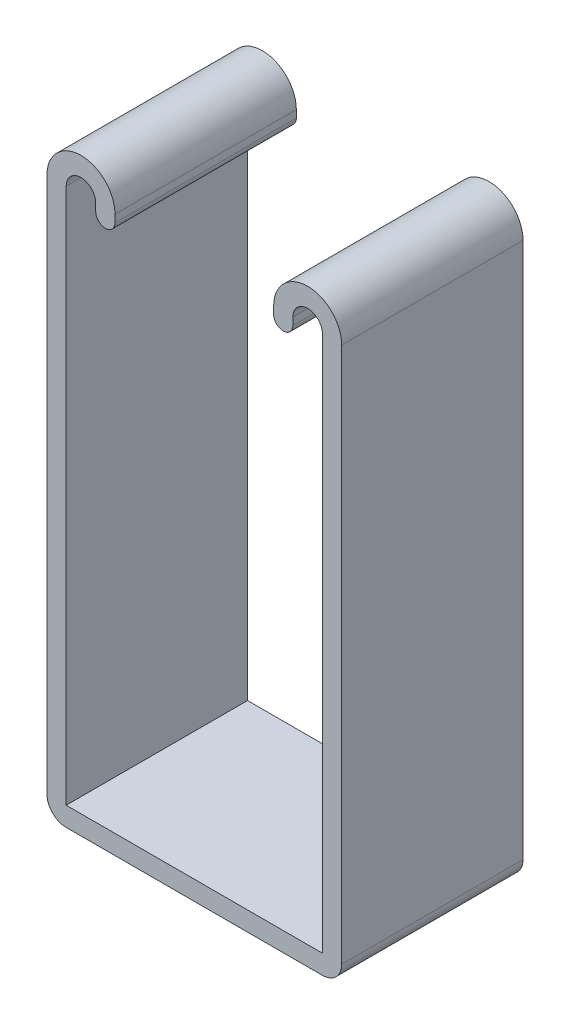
ISO-10303-21;
HEADER;
FILE_DESCRIPTION(('STEP AP214'),'2;1');
FILE_NAME('part.step','',(''),(''),'','','');
FILE_SCHEMA(('AUTOMOTIVE_DESIGN { 1 0 10303 214 1 1 1 1 }'));
ENDSEC;
DATA;
#1=APPLICATION_CONTEXT('core data for automotive mechanical design processes');
#2=APPLICATION_PROTOCOL_DEFINITION('international standard','automotive_design',2000,#1);
#3=PRODUCT_CONTEXT('',#1,'mechanical');
#4=PRODUCT('Part','Part','',(#3));
#5=PRODUCT_RELATED_PRODUCT_CATEGORY('part','',(#4));
#6=PRODUCT_DEFINITION_FORMATION('','',#4);
#7=PRODUCT_DEFINITION_CONTEXT('part definition',#1,'design');
#8=PRODUCT_DEFINITION('design','',#6,#7);
#9=PRODUCT_DEFINITION_SHAPE('','',#8);
#10=(LENGTH_UNIT() NAMED_UNIT(*) SI_UNIT(.MILLI.,.METRE.));
#11=(NAMED_UNIT(*) PLANE_ANGLE_UNIT() SI_UNIT($,.RADIAN.));
#12=(NAMED_UNIT(*) SI_UNIT($,.STERADIAN.) SOLID_ANGLE_UNIT());
#13=UNCERTAINTY_MEASURE_WITH_UNIT(LENGTH_MEASURE(1.E-05),#10,'distance_accuracy_value','');
#14=(GEOMETRIC_REPRESENTATION_CONTEXT(3) GLOBAL_UNCERTAINTY_ASSIGNED_CONTEXT((#13)) GLOBAL_UNIT_ASSIGNED_CONTEXT((#10,
#11,#12)) REPRESENTATION_CONTEXT('',''));
#15=CARTESIAN_POINT('',(0.,0.,0.));
#16=DIRECTION('',(0.,0.,1.));
#17=DIRECTION('',(1.,0.,0.));
#18=AXIS2_PLACEMENT_3D('',#15,#16,#17);
#19=CARTESIAN_POINT('',(-15.875,39.6875,12.7));
#20=DIRECTION('',(0.,0.,-1.));
#21=DIRECTION('',(-1.,0.,0.));
#22=AXIS2_PLACEMENT_3D('',#19,#20,#21);
#23=CYLINDRICAL_SURFACE('',#22,4.7625);
#24=CARTESIAN_POINT('',(-15.875,39.6875,-12.7));
#25=DIRECTION('',(0.,0.,1.));
#26=DIRECTION('',(-1.,0.,0.));
#27=AXIS2_PLACEMENT_3D('',#24,#25,#26);
#28=CIRCLE('',#27,4.7625);
#29=CARTESIAN_POINT('',(-11.1125,39.6875,-12.7));
#30=VERTEX_POINT('',#29);
#31=CARTESIAN_POINT('',(-20.6375,39.6875,-12.7));
#32=VERTEX_POINT('',#31);
#33=EDGE_CURVE('E195',#30,#32,#28,.T.);
#34=ORIENTED_EDGE('',*,*,#33,.T.);
#35=DIRECTION('',(0.,0.,-1.));
#36=VECTOR('',#35,1.);
#37=CARTESIAN_POINT('',(-20.6375,39.6875,12.7));
#38=LINE('',#37,#36);
#39=CARTESIAN_POINT('',(-20.6375,39.6875,12.7));
#40=VERTEX_POINT('',#39);
#41=EDGE_CURVE('E11',#40,#32,#38,.T.);
#42=ORIENTED_EDGE('',*,*,#41,.F.);
#43=CARTESIAN_POINT('',(-15.875,39.6875,12.7));
#44=DIRECTION('',(0.,0.,1.));
#45=DIRECTION('',(-1.,0.,0.));
#46=AXIS2_PLACEMENT_3D('',#43,#44,#45);
#47=CIRCLE('',#46,4.7625);
#48=CARTESIAN_POINT('',(-11.1125,39.6875,12.7));
#49=VERTEX_POINT('',#48);
#50=EDGE_CURVE('E229',#49,#40,#47,.T.);
#51=ORIENTED_EDGE('',*,*,#50,.F.);
#52=DIRECTION('',(0.,0.,-1.));
#53=VECTOR('',#52,1.);
#54=CARTESIAN_POINT('',(-11.1125,39.6875,12.7));
#55=LINE('',#54,#53);
#56=EDGE_CURVE('E191',#49,#30,#55,.T.);
#57=ORIENTED_EDGE('',*,*,#56,.T.);
#58=EDGE_LOOP('',(#34,#42,#51,#57));
#59=FACE_BOUND('',#58,.T.);
#60=ADVANCED_FACE('F39',(#59),#23,.T.);
#61=CARTESIAN_POINT('',(-20.6375,39.6875,12.7));
#62=DIRECTION('',(1.,0.,0.));
#63=DIRECTION('',(0.,1.,0.));
#64=AXIS2_PLACEMENT_3D('',#61,#62,#63);
#65=PLANE('',#64);
#66=DIRECTION('',(0.,-1.,0.));
#67=VECTOR('',#66,1.);
#68=CARTESIAN_POINT('',(-20.6375,39.6875,-12.7));
#69=LINE('',#68,#67);
#70=CARTESIAN_POINT('',(-20.6375,-35.4076,-12.7));
#71=VERTEX_POINT('',#70);
#72=EDGE_CURVE('E198',#32,#71,#69,.T.);
#73=ORIENTED_EDGE('',*,*,#72,.T.);
#74=DIRECTION('',(0.,0.,-1.));
#75=VECTOR('',#74,1.);
#76=CARTESIAN_POINT('',(-20.6375,-35.4076,12.7));
#77=LINE('',#76,#75);
#78=CARTESIAN_POINT('',(-20.6375,-35.4076,12.7));
#79=VERTEX_POINT('',#78);
#80=EDGE_CURVE('E47',#79,#71,#77,.T.);
#81=ORIENTED_EDGE('',*,*,#80,.F.);
#82=DIRECTION('',(0.,-1.,0.));
#83=VECTOR('',#82,1.);
#84=CARTESIAN_POINT('',(-20.6375,39.6875,12.7));
#85=LINE('',#84,#83);
#86=EDGE_CURVE('E128',#40,#79,#85,.T.);
#87=ORIENTED_EDGE('',*,*,#86,.F.);
#88=ORIENTED_EDGE('',*,*,#41,.T.);
#89=EDGE_LOOP('',(#73,#81,#87,#88));
#90=FACE_BOUND('',#89,.T.);
#91=ADVANCED_FACE('F337',(#90),#65,.F.);
#92=CARTESIAN_POINT('',(-17.9451,-35.4076,12.7));
#93=DIRECTION('',(0.,0.,-1.));
#94=DIRECTION('',(-1.,0.,0.));
#95=AXIS2_PLACEMENT_3D('',#92,#93,#94);
#96=CYLINDRICAL_SURFACE('',#95,2.6924);
#97=CARTESIAN_POINT('',(-17.9451,-35.4076,-12.7));
#98=DIRECTION('',(0.,0.,1.));
#99=DIRECTION('',(-1.,0.,0.));
#100=AXIS2_PLACEMENT_3D('',#97,#98,#99);
#101=CIRCLE('',#100,2.6924);
#102=CARTESIAN_POINT('',(-17.9451,-38.1,-12.7));
#103=VERTEX_POINT('',#102);
#104=EDGE_CURVE('E200',#71,#103,#101,.T.);
#105=ORIENTED_EDGE('',*,*,#104,.T.);
#106=DIRECTION('',(0.,0.,-1.));
#107=VECTOR('',#106,1.);
#108=CARTESIAN_POINT('',(-17.9451,-38.1,12.7));
#109=LINE('',#108,#107);
#110=CARTESIAN_POINT('',(-17.9451,-38.1,12.7));
#111=VERTEX_POINT('',#110);
#112=EDGE_CURVE('E266',#111,#103,#109,.T.);
#113=ORIENTED_EDGE('',*,*,#112,.F.);
#114=CARTESIAN_POINT('',(-17.9451,-35.4076,12.7));
#115=DIRECTION('',(0.,0.,1.));
#116=DIRECTION('',(-1.,0.,0.));
#117=AXIS2_PLACEMENT_3D('',#114,#115,#116);
#118=CIRCLE('',#117,2.6924);
#119=EDGE_CURVE('E274',#79,#111,#118,.T.);
#120=ORIENTED_EDGE('',*,*,#119,.F.);
#121=ORIENTED_EDGE('',*,*,#80,.T.);
#122=EDGE_LOOP('',(#105,#113,#120,#121));
#123=FACE_BOUND('',#122,.T.);
#124=ADVANCED_FACE('F272',(#123),#96,.T.);
#125=CARTESIAN_POINT('',(-17.9451,-38.1,12.7));
#126=DIRECTION('',(0.,1.,0.));
#127=DIRECTION('',(-1.,0.,0.));
#128=AXIS2_PLACEMENT_3D('',#125,#126,#127);
#129=PLANE('',#128);
#130=DIRECTION('',(1.,0.,0.));
#131=VECTOR('',#130,1.);
#132=CARTESIAN_POINT('',(-17.9451,-38.1,-12.7));
#133=LINE('',#132,#131);
#134=CARTESIAN_POINT('',(17.9451,-38.1,-12.7));
#135=VERTEX_POINT('',#134);
#136=EDGE_CURVE('E202',#103,#135,#133,.T.);
#137=ORIENTED_EDGE('',*,*,#136,.T.);
#138=DIRECTION('',(0.,0.,-1.));
#139=VECTOR('',#138,1.);
#140=CARTESIAN_POINT('',(17.9451,-38.1,12.7));
#141=LINE('',#140,#139);
#142=CARTESIAN_POINT('',(17.9451,-38.1,12.7));
#143=VERTEX_POINT('',#142);
#144=EDGE_CURVE('E263',#143,#135,#141,.T.);
#145=ORIENTED_EDGE('',*,*,#144,.F.);
#146=DIRECTION('',(1.,0.,0.));
#147=VECTOR('',#146,1.);
#148=CARTESIAN_POINT('',(-17.9451,-38.1,12.7));
#149=LINE('',#148,#147);
#150=EDGE_CURVE('E292',#111,#143,#149,.T.);
#151=ORIENTED_EDGE('',*,*,#150,.F.);
#152=ORIENTED_EDGE('',*,*,#112,.T.);
#153=EDGE_LOOP('',(#137,#145,#151,#152));
#154=FACE_BOUND('',#153,.T.);
#155=ADVANCED_FACE('F283',(#154),#129,.F.);
#156=CARTESIAN_POINT('',(17.9451,-35.4076,12.7));
#157=DIRECTION('',(0.,0.,-1.));
#158=DIRECTION('',(-1.,0.,0.));
#159=AXIS2_PLACEMENT_3D('',#156,#157,#158);
#160=CYLINDRICAL_SURFACE('',#159,2.6924);
#161=CARTESIAN_POINT('',(17.9451,-35.4076,-12.7));
#162=DIRECTION('',(0.,0.,1.));
#163=DIRECTION('',(1.,0.,0.));
#164=AXIS2_PLACEMENT_3D('',#161,#162,#163);
#165=CIRCLE('',#164,2.6924);
#166=CARTESIAN_POINT('',(20.6375,-35.4076,-12.7));
#167=VERTEX_POINT('',#166);
#168=EDGE_CURVE('E204',#135,#167,#165,.T.);
#169=ORIENTED_EDGE('',*,*,#168,.T.);
#170=DIRECTION('',(0.,0.,-1.));
#171=VECTOR('',#170,1.);
#172=CARTESIAN_POINT('',(20.6375,-35.4076,12.7));
#173=LINE('',#172,#171);
#174=CARTESIAN_POINT('',(20.6375,-35.4076,12.7));
#175=VERTEX_POINT('',#174);
#176=EDGE_CURVE('E260',#175,#167,#173,.T.);
#177=ORIENTED_EDGE('',*,*,#176,.F.);
#178=CARTESIAN_POINT('',(17.9451,-35.4076,12.7));
#179=DIRECTION('',(0.,0.,1.));
#180=DIRECTION('',(1.,0.,0.));
#181=AXIS2_PLACEMENT_3D('',#178,#179,#180);
#182=CIRCLE('',#181,2.6924);
#183=EDGE_CURVE('E289',#143,#175,#182,.T.);
#184=ORIENTED_EDGE('',*,*,#183,.F.);
#185=ORIENTED_EDGE('',*,*,#144,.T.);
#186=EDGE_LOOP('',(#169,#177,#184,#185));
#187=FACE_BOUND('',#186,.T.);
#188=ADVANCED_FACE('F287',(#187),#160,.T.);
#189=CARTESIAN_POINT('',(20.6375,-35.4076,12.7));
#190=DIRECTION('',(-1.,0.,0.));
#191=DIRECTION('',(0.,-1.,0.));
#192=AXIS2_PLACEMENT_3D('',#189,#190,#191);
#193=PLANE('',#192);
#194=DIRECTION('',(0.,1.,0.));
#195=VECTOR('',#194,1.);
#196=CARTESIAN_POINT('',(20.6375,-35.4076,-12.7));
#197=LINE('',#196,#195);
#198=CARTESIAN_POINT('',(20.6375,39.6875,-12.7));
#199=VERTEX_POINT('',#198);
#200=EDGE_CURVE('E206',#167,#199,#197,.T.);
#201=ORIENTED_EDGE('',*,*,#200,.T.);
#202=DIRECTION('',(0.,0.,-1.));
#203=VECTOR('',#202,1.);
#204=CARTESIAN_POINT('',(20.6375,39.6875,12.7));
#205=LINE('',#204,#203);
#206=CARTESIAN_POINT('',(20.6375,39.6875,12.7));
#207=VERTEX_POINT('',#206);
#208=EDGE_CURVE('E257',#207,#199,#205,.T.);
#209=ORIENTED_EDGE('',*,*,#208,.F.);
#210=DIRECTION('',(0.,1.,0.));
#211=VECTOR('',#210,1.);
#212=CARTESIAN_POINT('',(20.6375,-35.4076,12.7));
#213=LINE('',#212,#211);
#214=EDGE_CURVE('E291',#175,#207,#213,.T.);
#215=ORIENTED_EDGE('',*,*,#214,.F.);
#216=ORIENTED_EDGE('',*,*,#176,.T.);
#217=EDGE_LOOP('',(#201,#209,#215,#216));
#218=FACE_BOUND('',#217,.T.);
#219=ADVANCED_FACE('F350',(#218),#193,.F.);
#220=CARTESIAN_POINT('',(15.875,39.6875,12.7));
#221=DIRECTION('',(0.,0.,-1.));
#222=DIRECTION('',(-1.,0.,0.));
#223=AXIS2_PLACEMENT_3D('',#220,#221,#222);
#224=CYLINDRICAL_SURFACE('',#223,4.7625);
#225=CARTESIAN_POINT('',(15.875,39.6875,-12.7));
#226=DIRECTION('',(0.,0.,1.));
#227=DIRECTION('',(1.,0.,0.));
#228=AXIS2_PLACEMENT_3D('',#225,#226,#227);
#229=CIRCLE('',#228,4.7625);
#230=CARTESIAN_POINT('',(11.1125,39.6875,-12.7));
#231=VERTEX_POINT('',#230);
#232=EDGE_CURVE('E208',#199,#231,#229,.T.);
#233=ORIENTED_EDGE('',*,*,#232,.T.);
#234=DIRECTION('',(0.,0.,-1.));
#235=VECTOR('',#234,1.);
#236=CARTESIAN_POINT('',(11.1125,39.6875,12.7));
#237=LINE('',#236,#235);
#238=CARTESIAN_POINT('',(11.1125,39.6875,12.7));
#239=VERTEX_POINT('',#238);
#240=EDGE_CURVE('E254',#239,#231,#237,.T.);
#241=ORIENTED_EDGE('',*,*,#240,.F.);
#242=CARTESIAN_POINT('',(15.875,39.6875,12.7));
#243=DIRECTION('',(0.,0.,1.));
#244=DIRECTION('',(1.,0.,0.));
#245=AXIS2_PLACEMENT_3D('',#242,#243,#244);
#246=CIRCLE('',#245,4.7625);
#247=EDGE_CURVE('E294',#207,#239,#246,.T.);
#248=ORIENTED_EDGE('',*,*,#247,.F.);
#249=ORIENTED_EDGE('',*,*,#208,.T.);
#250=EDGE_LOOP('',(#233,#241,#248,#249));
#251=FACE_BOUND('',#250,.T.);
#252=ADVANCED_FACE('F353',(#251),#224,.T.);
#253=CARTESIAN_POINT('',(11.1125,39.6875,12.7));
#254=DIRECTION('',(1.,0.,0.));
#255=DIRECTION('',(0.,1.,0.));
#256=AXIS2_PLACEMENT_3D('',#253,#254,#255);
#257=PLANE('',#256);
#258=DIRECTION('',(0.,-1.,0.));
#259=VECTOR('',#258,1.);
#260=CARTESIAN_POINT('',(11.1125,39.6875,-12.7));
#261=LINE('',#260,#259);
#262=CARTESIAN_POINT('',(11.1125,38.65245,-12.7));
#263=VERTEX_POINT('',#262);
#264=EDGE_CURVE('E210',#231,#263,#261,.T.);
#265=ORIENTED_EDGE('',*,*,#264,.T.);
#266=DIRECTION('',(0.,0.,-1.));
#267=VECTOR('',#266,1.);
#268=CARTESIAN_POINT('',(11.1125,38.65245,12.7));
#269=LINE('',#268,#267);
#270=CARTESIAN_POINT('',(11.1125,38.65245,12.7));
#271=VERTEX_POINT('',#270);
#272=EDGE_CURVE('E251',#271,#263,#269,.T.);
#273=ORIENTED_EDGE('',*,*,#272,.F.);
#274=DIRECTION('',(0.,-1.,0.));
#275=VECTOR('',#274,1.);
#276=CARTESIAN_POINT('',(11.1125,39.6875,12.7));
#277=LINE('',#276,#275);
#278=EDGE_CURVE('E300',#239,#271,#277,.T.);
#279=ORIENTED_EDGE('',*,*,#278,.F.);
#280=ORIENTED_EDGE('',*,*,#240,.T.);
#281=EDGE_LOOP('',(#265,#273,#279,#280));
#282=FACE_BOUND('',#281,.T.);
#283=ADVANCED_FACE('F357',(#282),#257,.F.);
#284=CARTESIAN_POINT('',(12.4587,38.65245,12.7));
#285=DIRECTION('',(0.,0.,-1.));
#286=DIRECTION('',(-1.,0.,0.));
#287=AXIS2_PLACEMENT_3D('',#284,#285,#286);
#288=CYLINDRICAL_SURFACE('',#287,1.3462);
#289=CARTESIAN_POINT('',(12.4587,38.65245,-12.7));
#290=DIRECTION('',(0.,0.,1.));
#291=DIRECTION('',(1.,0.,0.));
#292=AXIS2_PLACEMENT_3D('',#289,#290,#291);
#293=CIRCLE('',#292,1.3462);
#294=CARTESIAN_POINT('',(13.8049,38.65245,-12.7));
#295=VERTEX_POINT('',#294);
#296=EDGE_CURVE('E212',#263,#295,#293,.T.);
#297=ORIENTED_EDGE('',*,*,#296,.T.);
#298=DIRECTION('',(0.,0.,-1.));
#299=VECTOR('',#298,1.);
#300=CARTESIAN_POINT('',(13.8049,38.65245,12.7));
#301=LINE('',#300,#299);
#302=CARTESIAN_POINT('',(13.8049,38.65245,12.7));
#303=VERTEX_POINT('',#302);
#304=EDGE_CURVE('E248',#303,#295,#301,.T.);
#305=ORIENTED_EDGE('',*,*,#304,.F.);
#306=CARTESIAN_POINT('',(12.4587,38.65245,12.7));
#307=DIRECTION('',(0.,0.,1.));
#308=DIRECTION('',(1.,0.,0.));
#309=AXIS2_PLACEMENT_3D('',#306,#307,#308);
#310=CIRCLE('',#309,1.3462);
#311=EDGE_CURVE('E302',#271,#303,#310,.T.);
#312=ORIENTED_EDGE('',*,*,#311,.F.);
#313=ORIENTED_EDGE('',*,*,#272,.T.);
#314=EDGE_LOOP('',(#297,#305,#312,#313));
#315=FACE_BOUND('',#314,.T.);
#316=ADVANCED_FACE('F361',(#315),#288,.T.);
#317=CARTESIAN_POINT('',(13.8049,39.6875,12.7));
#318=DIRECTION('',(-1.,0.,0.));
#319=DIRECTION('',(0.,0.,1.));
#320=AXIS2_PLACEMENT_3D('',#317,#318,#319);
#321=PLANE('',#320);
#322=DIRECTION('',(0.,1.,0.));
#323=VECTOR('',#322,1.);
#324=CARTESIAN_POINT('',(13.8049,39.6875,-12.7));
#325=LINE('',#324,#323);
#326=CARTESIAN_POINT('',(13.8049,39.6875,-12.7));
#327=VERTEX_POINT('',#326);
#328=EDGE_CURVE('E214',#295,#327,#325,.T.);
#329=ORIENTED_EDGE('',*,*,#328,.T.);
#330=DIRECTION('',(0.,0.,-1.));
#331=VECTOR('',#330,1.);
#332=CARTESIAN_POINT('',(13.8049,39.6875,12.7));
#333=LINE('',#332,#331);
#334=CARTESIAN_POINT('',(13.8049,39.6875,12.7));
#335=VERTEX_POINT('',#334);
#336=EDGE_CURVE('E245',#335,#327,#333,.T.);
#337=ORIENTED_EDGE('',*,*,#336,.F.);
#338=DIRECTION('',(0.,1.,0.));
#339=VECTOR('',#338,1.);
#340=CARTESIAN_POINT('',(13.8049,39.6875,12.7));
#341=LINE('',#340,#339);
#342=EDGE_CURVE('E304',#303,#335,#341,.T.);
#343=ORIENTED_EDGE('',*,*,#342,.F.);
#344=ORIENTED_EDGE('',*,*,#304,.T.);
#345=EDGE_LOOP('',(#329,#337,#343,#344));
#346=FACE_BOUND('',#345,.T.);
#347=ADVANCED_FACE('F365',(#346),#321,.F.);
#348=CARTESIAN_POINT('',(15.875,39.6875,12.7));
#349=DIRECTION('',(0.,0.,-1.));
#350=DIRECTION('',(-1.,0.,0.));
#351=AXIS2_PLACEMENT_3D('',#348,#349,#350);
#352=CYLINDRICAL_SURFACE('',#351,2.07010000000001);
#353=CARTESIAN_POINT('',(15.875,39.6875,-12.7));
#354=DIRECTION('',(0.,0.,-1.));
#355=DIRECTION('',(1.,0.,0.));
#356=AXIS2_PLACEMENT_3D('',#353,#354,#355);
#357=CIRCLE('',#356,2.07010000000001);
#358=CARTESIAN_POINT('',(17.9451,39.6875,-12.7));
#359=VERTEX_POINT('',#358);
#360=EDGE_CURVE('E216',#327,#359,#357,.T.);
#361=ORIENTED_EDGE('',*,*,#360,.T.);
#362=DIRECTION('',(0.,0.,-1.));
#363=VECTOR('',#362,1.);
#364=CARTESIAN_POINT('',(17.9451,39.6875,12.7));
#365=LINE('',#364,#363);
#366=CARTESIAN_POINT('',(17.9451,39.6875,12.7));
#367=VERTEX_POINT('',#366);
#368=EDGE_CURVE('E242',#367,#359,#365,.T.);
#369=ORIENTED_EDGE('',*,*,#368,.F.);
#370=CARTESIAN_POINT('',(15.875,39.6875,12.7));
#371=DIRECTION('',(0.,0.,-1.));
#372=DIRECTION('',(1.,0.,0.));
#373=AXIS2_PLACEMENT_3D('',#370,#371,#372);
#374=CIRCLE('',#373,2.07010000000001);
#375=EDGE_CURVE('E306',#335,#367,#374,.T.);
#376=ORIENTED_EDGE('',*,*,#375,.F.);
#377=ORIENTED_EDGE('',*,*,#336,.T.);
#378=EDGE_LOOP('',(#361,#369,#376,#377));
#379=FACE_BOUND('',#378,.T.);
#380=ADVANCED_FACE('F369',(#379),#352,.F.);
#381=CARTESIAN_POINT('',(17.9451,-35.4076,12.7));
#382=DIRECTION('',(1.,0.,0.));
#383=DIRECTION('',(0.,0.,-1.));
#384=AXIS2_PLACEMENT_3D('',#381,#382,#383);
#385=PLANE('',#384);
#386=DIRECTION('',(0.,-1.,0.));
#387=VECTOR('',#386,1.);
#388=CARTESIAN_POINT('',(17.9451,-35.4076,-12.7));
#389=LINE('',#388,#387);
#390=CARTESIAN_POINT('',(17.9451,-35.4076,-12.7));
#391=VERTEX_POINT('',#390);
#392=EDGE_CURVE('E218',#359,#391,#389,.T.);
#393=ORIENTED_EDGE('',*,*,#392,.T.);
#394=DIRECTION('',(0.,0.,-1.));
#395=VECTOR('',#394,1.);
#396=CARTESIAN_POINT('',(17.9451,-35.4076,12.7));
#397=LINE('',#396,#395);
#398=CARTESIAN_POINT('',(17.9451,-35.4076,12.7));
#399=VERTEX_POINT('',#398);
#400=EDGE_CURVE('E239',#399,#391,#397,.T.);
#401=ORIENTED_EDGE('',*,*,#400,.F.);
#402=DIRECTION('',(0.,-1.,0.));
#403=VECTOR('',#402,1.);
#404=CARTESIAN_POINT('',(17.9451,-35.4076,12.7));
#405=LINE('',#404,#403);
#406=EDGE_CURVE('E308',#367,#399,#405,.T.);
#407=ORIENTED_EDGE('',*,*,#406,.F.);
#408=ORIENTED_EDGE('',*,*,#368,.T.);
#409=EDGE_LOOP('',(#393,#401,#407,#408));
#410=FACE_BOUND('',#409,.T.);
#411=ADVANCED_FACE('F373',(#410),#385,.F.);
#412=CARTESIAN_POINT('',(-17.9451,-35.4076,12.7));
#413=DIRECTION('',(0.,-1.,0.));
#414=DIRECTION('',(0.,0.,-1.));
#415=AXIS2_PLACEMENT_3D('',#412,#413,#414);
#416=PLANE('',#415);
#417=DIRECTION('',(-1.,0.,0.));
#418=VECTOR('',#417,1.);
#419=CARTESIAN_POINT('',(-17.9451,-35.4076,-12.7));
#420=LINE('',#419,#418);
#421=CARTESIAN_POINT('',(-17.9451,-35.4076,-12.7));
#422=VERTEX_POINT('',#421);
#423=EDGE_CURVE('E220',#391,#422,#420,.T.);
#424=ORIENTED_EDGE('',*,*,#423,.T.);
#425=DIRECTION('',(0.,0.,-1.));
#426=VECTOR('',#425,1.);
#427=CARTESIAN_POINT('',(-17.9451,-35.4076,12.7));
#428=LINE('',#427,#426);
#429=CARTESIAN_POINT('',(-17.9451,-35.4076,12.7));
#430=VERTEX_POINT('',#429);
#431=EDGE_CURVE('E236',#430,#422,#428,.T.);
#432=ORIENTED_EDGE('',*,*,#431,.F.);
#433=DIRECTION('',(-1.,0.,0.));
#434=VECTOR('',#433,1.);
#435=CARTESIAN_POINT('',(-17.9451,-35.4076,12.7));
#436=LINE('',#435,#434);
#437=EDGE_CURVE('E310',#399,#430,#436,.T.);
#438=ORIENTED_EDGE('',*,*,#437,.F.);
#439=ORIENTED_EDGE('',*,*,#400,.T.);
#440=EDGE_LOOP('',(#424,#432,#438,#439));
#441=FACE_BOUND('',#440,.T.);
#442=ADVANCED_FACE('F377',(#441),#416,.F.);
#443=CARTESIAN_POINT('',(-17.9451,39.6875,12.7));
#444=DIRECTION('',(-1.,0.,0.));
#445=DIRECTION('',(0.,-1.,0.));
#446=AXIS2_PLACEMENT_3D('',#443,#444,#445);
#447=PLANE('',#446);
#448=DIRECTION('',(0.,1.,0.));
#449=VECTOR('',#448,1.);
#450=CARTESIAN_POINT('',(-17.9451,39.6875,-12.7));
#451=LINE('',#450,#449);
#452=CARTESIAN_POINT('',(-17.9451,39.6875,-12.7));
#453=VERTEX_POINT('',#452);
#454=EDGE_CURVE('E222',#422,#453,#451,.T.);
#455=ORIENTED_EDGE('',*,*,#454,.T.);
#456=DIRECTION('',(0.,0.,-1.));
#457=VECTOR('',#456,1.);
#458=CARTESIAN_POINT('',(-17.9451,39.6875,12.7));
#459=LINE('',#458,#457);
#460=CARTESIAN_POINT('',(-17.9451,39.6875,12.7));
#461=VERTEX_POINT('',#460);
#462=EDGE_CURVE('E233',#461,#453,#459,.T.);
#463=ORIENTED_EDGE('',*,*,#462,.F.);
#464=DIRECTION('',(0.,1.,0.));
#465=VECTOR('',#464,1.);
#466=CARTESIAN_POINT('',(-17.9451,39.6875,12.7));
#467=LINE('',#466,#465);
#468=EDGE_CURVE('E312',#430,#461,#467,.T.);
#469=ORIENTED_EDGE('',*,*,#468,.F.);
#470=ORIENTED_EDGE('',*,*,#431,.T.);
#471=EDGE_LOOP('',(#455,#463,#469,#470));
#472=FACE_BOUND('',#471,.T.);
#473=ADVANCED_FACE('F318',(#472),#447,.F.);
#474=CARTESIAN_POINT('',(-15.875,39.6875,12.7));
#475=DIRECTION('',(0.,0.,-1.));
#476=DIRECTION('',(-1.,0.,0.));
#477=AXIS2_PLACEMENT_3D('',#474,#475,#476);
#478=CYLINDRICAL_SURFACE('',#477,2.0701);
#479=CARTESIAN_POINT('',(-15.875,39.6875,-12.7));
#480=DIRECTION('',(0.,0.,-1.));
#481=DIRECTION('',(-1.,0.,0.));
#482=AXIS2_PLACEMENT_3D('',#479,#480,#481);
#483=CIRCLE('',#482,2.0701);
#484=CARTESIAN_POINT('',(-13.8049,39.6875,-12.7));
#485=VERTEX_POINT('',#484);
#486=EDGE_CURVE('E224',#453,#485,#483,.T.);
#487=ORIENTED_EDGE('',*,*,#486,.T.);
#488=DIRECTION('',(0.,0.,-1.));
#489=VECTOR('',#488,1.);
#490=CARTESIAN_POINT('',(-13.8049,39.6875,12.7));
#491=LINE('',#490,#489);
#492=CARTESIAN_POINT('',(-13.8049,39.6875,12.7));
#493=VERTEX_POINT('',#492);
#494=EDGE_CURVE('E186',#493,#485,#491,.T.);
#495=ORIENTED_EDGE('',*,*,#494,.F.);
#496=CARTESIAN_POINT('',(-15.875,39.6875,12.7));
#497=DIRECTION('',(0.,0.,-1.));
#498=DIRECTION('',(-1.,0.,0.));
#499=AXIS2_PLACEMENT_3D('',#496,#497,#498);
#500=CIRCLE('',#499,2.0701);
#501=EDGE_CURVE('E177',#461,#493,#500,.T.);
#502=ORIENTED_EDGE('',*,*,#501,.F.);
#503=ORIENTED_EDGE('',*,*,#462,.T.);
#504=EDGE_LOOP('',(#487,#495,#502,#503));
#505=FACE_BOUND('',#504,.T.);
#506=ADVANCED_FACE('F322',(#505),#478,.F.);
#507=CARTESIAN_POINT('',(-13.8049,39.6875,12.7));
#508=DIRECTION('',(1.,0.,0.));
#509=DIRECTION('',(0.,1.,0.));
#510=AXIS2_PLACEMENT_3D('',#507,#508,#509);
#511=PLANE('',#510);
#512=DIRECTION('',(0.,-1.,0.));
#513=VECTOR('',#512,1.);
#514=CARTESIAN_POINT('',(-13.8049,39.6875,-12.7));
#515=LINE('',#514,#513);
#516=CARTESIAN_POINT('',(-13.8049,38.65245,-12.7));
#517=VERTEX_POINT('',#516);
#518=EDGE_CURVE('E185',#485,#517,#515,.T.);
#519=ORIENTED_EDGE('',*,*,#518,.T.);
#520=DIRECTION('',(0.,0.,-1.));
#521=VECTOR('',#520,1.);
#522=CARTESIAN_POINT('',(-13.8049,38.65245,12.7));
#523=LINE('',#522,#521);
#524=CARTESIAN_POINT('',(-13.8049,38.65245,12.7));
#525=VERTEX_POINT('',#524);
#526=EDGE_CURVE('E182',#525,#517,#523,.T.);
#527=ORIENTED_EDGE('',*,*,#526,.F.);
#528=DIRECTION('',(0.,-1.,0.));
#529=VECTOR('',#528,1.);
#530=CARTESIAN_POINT('',(-13.8049,39.6875,12.7));
#531=LINE('',#530,#529);
#532=EDGE_CURVE('E171',#493,#525,#531,.T.);
#533=ORIENTED_EDGE('',*,*,#532,.F.);
#534=ORIENTED_EDGE('',*,*,#494,.T.);
#535=EDGE_LOOP('',(#519,#527,#533,#534));
#536=FACE_BOUND('',#535,.T.);
#537=ADVANCED_FACE('F183',(#536),#511,.F.);
#538=CARTESIAN_POINT('',(-12.4587,38.65245,12.7));
#539=DIRECTION('',(0.,0.,-1.));
#540=DIRECTION('',(-1.,0.,0.));
#541=AXIS2_PLACEMENT_3D('',#538,#539,#540);
#542=CYLINDRICAL_SURFACE('',#541,1.3462);
#543=CARTESIAN_POINT('',(-12.4587,38.65245,-12.7));
#544=DIRECTION('',(0.,0.,1.));
#545=DIRECTION('',(-1.,0.,0.));
#546=AXIS2_PLACEMENT_3D('',#543,#544,#545);
#547=CIRCLE('',#546,1.3462);
#548=CARTESIAN_POINT('',(-11.1125,38.65245,-12.7));
#549=VERTEX_POINT('',#548);
#550=EDGE_CURVE('E114',#517,#549,#547,.T.);
#551=ORIENTED_EDGE('',*,*,#550,.T.);
#552=DIRECTION('',(0.,0.,-1.));
#553=VECTOR('',#552,1.);
#554=CARTESIAN_POINT('',(-11.1125,38.65245,12.7));
#555=LINE('',#554,#553);
#556=CARTESIAN_POINT('',(-11.1125,38.65245,12.7));
#557=VERTEX_POINT('',#556);
#558=EDGE_CURVE('E187',#557,#549,#555,.T.);
#559=ORIENTED_EDGE('',*,*,#558,.F.);
#560=CARTESIAN_POINT('',(-12.4587,38.65245,12.7));
#561=DIRECTION('',(0.,0.,1.));
#562=DIRECTION('',(-1.,0.,0.));
#563=AXIS2_PLACEMENT_3D('',#560,#561,#562);
#564=CIRCLE('',#563,1.3462);
#565=EDGE_CURVE('E175',#525,#557,#564,.T.);
#566=ORIENTED_EDGE('',*,*,#565,.F.);
#567=ORIENTED_EDGE('',*,*,#526,.T.);
#568=EDGE_LOOP('',(#551,#559,#566,#567));
#569=FACE_BOUND('',#568,.T.);
#570=ADVANCED_FACE('F189',(#569),#542,.T.);
#571=CARTESIAN_POINT('',(-11.1125,39.6875,12.7));
#572=DIRECTION('',(-1.,0.,0.));
#573=DIRECTION('',(0.,-1.,0.));
#574=AXIS2_PLACEMENT_3D('',#571,#572,#573);
#575=PLANE('',#574);
#576=DIRECTION('',(0.,1.,0.));
#577=VECTOR('',#576,1.);
#578=CARTESIAN_POINT('',(-11.1125,39.6875,-12.7));
#579=LINE('',#578,#577);
#580=EDGE_CURVE('E120',#549,#30,#579,.T.);
#581=ORIENTED_EDGE('',*,*,#580,.T.);
#582=ORIENTED_EDGE('',*,*,#56,.F.);
#583=DIRECTION('',(0.,1.,0.));
#584=VECTOR('',#583,1.);
#585=CARTESIAN_POINT('',(-11.1125,39.6875,12.7));
#586=LINE('',#585,#584);
#587=EDGE_CURVE('E55',#557,#49,#586,.T.);
#588=ORIENTED_EDGE('',*,*,#587,.F.);
#589=ORIENTED_EDGE('',*,*,#558,.T.);
#590=EDGE_LOOP('',(#581,#582,#588,#589));
#591=FACE_BOUND('',#590,.T.);
#592=ADVANCED_FACE('F326',(#591),#575,.F.);
#593=CARTESIAN_POINT('',(-15.875,39.6875,12.7));
#594=DIRECTION('',(0.,0.,-1.));
#595=DIRECTION('',(-1.,0.,0.));
#596=AXIS2_PLACEMENT_3D('',#593,#594,#595);
#597=PLANE('',#596);
#598=ORIENTED_EDGE('',*,*,#50,.T.);
#599=ORIENTED_EDGE('',*,*,#86,.T.);
#600=ORIENTED_EDGE('',*,*,#119,.T.);
#601=ORIENTED_EDGE('',*,*,#150,.T.);
#602=ORIENTED_EDGE('',*,*,#183,.T.);
#603=ORIENTED_EDGE('',*,*,#214,.T.);
#604=ORIENTED_EDGE('',*,*,#247,.T.);
#605=ORIENTED_EDGE('',*,*,#278,.T.);
#606=ORIENTED_EDGE('',*,*,#311,.T.);
#607=ORIENTED_EDGE('',*,*,#342,.T.);
#608=ORIENTED_EDGE('',*,*,#375,.T.);
#609=ORIENTED_EDGE('',*,*,#406,.T.);
#610=ORIENTED_EDGE('',*,*,#437,.T.);
#611=ORIENTED_EDGE('',*,*,#468,.T.);
#612=ORIENTED_EDGE('',*,*,#501,.T.);
#613=ORIENTED_EDGE('',*,*,#532,.T.);
#614=ORIENTED_EDGE('',*,*,#565,.T.);
#615=ORIENTED_EDGE('',*,*,#587,.T.);
#616=EDGE_LOOP('',(#598,#599,#600,#601,#602,#603,#604,#605,#606,#607,#608,#609,#610,#611,#612,
#613,#614,#615));
#617=FACE_BOUND('',#616,.T.);
#618=ADVANCED_FACE('F173',(#617),#597,.F.);
#619=CARTESIAN_POINT('',(-15.875,39.6875,-12.7));
#620=DIRECTION('',(0.,0.,-1.));
#621=DIRECTION('',(-1.,0.,0.));
#622=AXIS2_PLACEMENT_3D('',#619,#620,#621);
#623=PLANE('',#622);
#624=ORIENTED_EDGE('',*,*,#33,.F.);
#625=ORIENTED_EDGE('',*,*,#580,.F.);
#626=ORIENTED_EDGE('',*,*,#550,.F.);
#627=ORIENTED_EDGE('',*,*,#518,.F.);
#628=ORIENTED_EDGE('',*,*,#486,.F.);
#629=ORIENTED_EDGE('',*,*,#454,.F.);
#630=ORIENTED_EDGE('',*,*,#423,.F.);
#631=ORIENTED_EDGE('',*,*,#392,.F.);
#632=ORIENTED_EDGE('',*,*,#360,.F.);
#633=ORIENTED_EDGE('',*,*,#328,.F.);
#634=ORIENTED_EDGE('',*,*,#296,.F.);
#635=ORIENTED_EDGE('',*,*,#264,.F.);
#636=ORIENTED_EDGE('',*,*,#232,.F.);
#637=ORIENTED_EDGE('',*,*,#200,.F.);
#638=ORIENTED_EDGE('',*,*,#168,.F.);
#639=ORIENTED_EDGE('',*,*,#136,.F.);
#640=ORIENTED_EDGE('',*,*,#104,.F.);
#641=ORIENTED_EDGE('',*,*,#72,.F.);
#642=EDGE_LOOP('',(#624,#625,#626,#627,#628,#629,#630,#631,#632,#633,#634,#635,#636,#637,#638,
#639,#640,#641));
#643=FACE_BOUND('',#642,.T.);
#644=ADVANCED_FACE('F278',(#643),#623,.T.);
#645=CLOSED_SHELL('',(#60,#91,#124,#155,#188,#219,#252,#283,#316,#347,#380,#411,#442,#473,#506,
#537,#570,#592,#618,#644));
#646=MANIFOLD_SOLID_BREP('B2',#645);
#647=ADVANCED_BREP_SHAPE_REPRESENTATION('',(#18,#646),#14);
#648=SHAPE_DEFINITION_REPRESENTATION(#9,#647);
ENDSEC;
END-ISO-10303-21;
